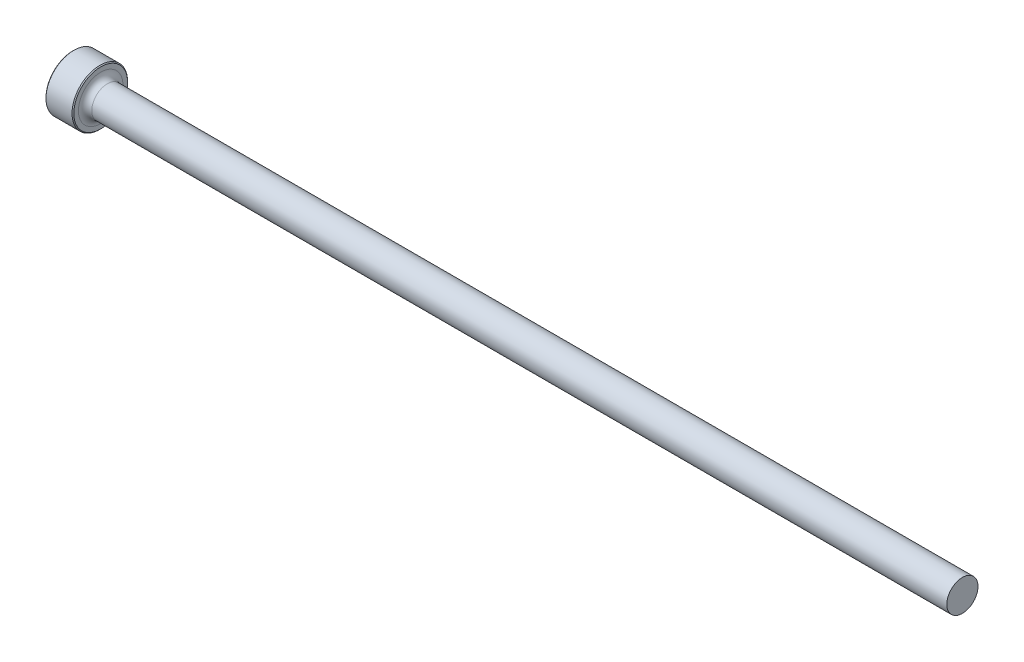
ISO-10303-21;
HEADER;
FILE_DESCRIPTION(('STEP AP214'),'2;1');
FILE_NAME('part.step','',(''),(''),'','','');
FILE_SCHEMA(('AUTOMOTIVE_DESIGN { 1 0 10303 214 1 1 1 1 }'));
ENDSEC;
DATA;
#1=APPLICATION_CONTEXT('core data for automotive mechanical design processes');
#2=APPLICATION_PROTOCOL_DEFINITION('international standard','automotive_design',2000,#1);
#3=PRODUCT_CONTEXT('',#1,'mechanical');
#4=PRODUCT('Part','Part','',(#3));
#5=PRODUCT_RELATED_PRODUCT_CATEGORY('part','',(#4));
#6=PRODUCT_DEFINITION_FORMATION('','',#4);
#7=PRODUCT_DEFINITION_CONTEXT('part definition',#1,'design');
#8=PRODUCT_DEFINITION('design','',#6,#7);
#9=PRODUCT_DEFINITION_SHAPE('','',#8);
#10=(LENGTH_UNIT() NAMED_UNIT(*) SI_UNIT(.MILLI.,.METRE.));
#11=(NAMED_UNIT(*) PLANE_ANGLE_UNIT() SI_UNIT($,.RADIAN.));
#12=(NAMED_UNIT(*) SI_UNIT($,.STERADIAN.) SOLID_ANGLE_UNIT());
#13=UNCERTAINTY_MEASURE_WITH_UNIT(LENGTH_MEASURE(1.E-05),#10,'distance_accuracy_value','');
#14=(GEOMETRIC_REPRESENTATION_CONTEXT(3) GLOBAL_UNCERTAINTY_ASSIGNED_CONTEXT((#13)) GLOBAL_UNIT_ASSIGNED_CONTEXT((#10,
#11,#12)) REPRESENTATION_CONTEXT('',''));
#15=CARTESIAN_POINT('',(0.,0.,0.));
#16=DIRECTION('',(0.,0.,1.));
#17=DIRECTION('',(1.,0.,0.));
#18=AXIS2_PLACEMENT_3D('',#15,#16,#17);
#19=CARTESIAN_POINT('',(101.6,1.78212749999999,0.));
#20=DIRECTION('',(1.,0.,0.));
#21=DIRECTION('',(0.,1.,0.));
#22=AXIS2_PLACEMENT_3D('',#19,#20,#21);
#23=PLANE('',#22);
#24=CARTESIAN_POINT('',(101.6,0.,0.));
#25=DIRECTION('',(1.,0.,0.));
#26=DIRECTION('',(0.,1.,0.));
#27=AXIS2_PLACEMENT_3D('',#24,#25,#26);
#28=CIRCLE('',#27,1.7821275);
#29=CARTESIAN_POINT('',(101.6,1.78212749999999,0.));
#30=VERTEX_POINT('',#29);
#31=EDGE_CURVE('E50',#30,#30,#28,.T.);
#32=ORIENTED_EDGE('',*,*,#31,.T.);
#33=EDGE_LOOP('',(#32));
#34=FACE_BOUND('',#33,.T.);
#35=ADVANCED_FACE('F30',(#34),#23,.T.);
#36=CARTESIAN_POINT('',(101.6,0.,0.));
#37=DIRECTION('',(1.,0.,0.));
#38=DIRECTION('',(0.,1.,0.));
#39=AXIS2_PLACEMENT_3D('',#36,#37,#38);
#40=CYLINDRICAL_SURFACE('',#39,1.7821275);
#41=CARTESIAN_POINT('',(3.937,0.,0.));
#42=DIRECTION('',(1.,0.,0.));
#43=DIRECTION('',(0.,1.,0.));
#44=AXIS2_PLACEMENT_3D('',#41,#42,#43);
#45=CIRCLE('',#44,1.78212749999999);
#46=CARTESIAN_POINT('',(3.937,1.78212749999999,0.));
#47=VERTEX_POINT('',#46);
#48=EDGE_CURVE('E53',#47,#47,#45,.T.);
#49=ORIENTED_EDGE('',*,*,#48,.T.);
#50=EDGE_LOOP('',(#49));
#51=FACE_BOUND('',#50,.T.);
#52=ORIENTED_EDGE('',*,*,#31,.F.);
#53=EDGE_LOOP('',(#52));
#54=FACE_BOUND('',#53,.T.);
#55=ADVANCED_FACE('F74',(#51,#54),#40,.T.);
#56=CARTESIAN_POINT('',(3.937,0.,0.));
#57=DIRECTION('',(1.,0.,0.));
#58=DIRECTION('',(0.,1.,0.));
#59=AXIS2_PLACEMENT_3D('',#56,#57,#58);
#60=TOROIDAL_SURFACE('',#59,2.54412749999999,0.762);
#61=CARTESIAN_POINT('',(3.175,0.,0.));
#62=DIRECTION('',(1.,0.,0.));
#63=DIRECTION('',(0.,1.,0.));
#64=AXIS2_PLACEMENT_3D('',#61,#62,#63);
#65=CIRCLE('',#64,2.54412749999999);
#66=CARTESIAN_POINT('',(3.175,2.54412749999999,0.));
#67=VERTEX_POINT('',#66);
#68=EDGE_CURVE('E56',#67,#67,#65,.T.);
#69=ORIENTED_EDGE('',*,*,#68,.T.);
#70=EDGE_LOOP('',(#69));
#71=FACE_BOUND('',#70,.T.);
#72=ORIENTED_EDGE('',*,*,#48,.F.);
#73=EDGE_LOOP('',(#72));
#74=FACE_BOUND('',#73,.T.);
#75=ADVANCED_FACE('F60',(#71,#74),#60,.F.);
#76=CARTESIAN_POINT('',(3.175,3.175,0.));
#77=DIRECTION('',(1.,0.,0.));
#78=DIRECTION('',(0.,1.,0.));
#79=AXIS2_PLACEMENT_3D('',#76,#77,#78);
#80=PLANE('',#79);
#81=CARTESIAN_POINT('',(3.175,0.,0.));
#82=DIRECTION('',(1.,0.,0.));
#83=DIRECTION('',(0.,1.,0.));
#84=AXIS2_PLACEMENT_3D('',#81,#82,#83);
#85=CIRCLE('',#84,3.07339999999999);
#86=CARTESIAN_POINT('',(3.175,3.07339999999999,0.));
#87=VERTEX_POINT('',#86);
#88=EDGE_CURVE('E10',#87,#87,#85,.T.);
#89=ORIENTED_EDGE('',*,*,#88,.T.);
#90=EDGE_LOOP('',(#89));
#91=FACE_BOUND('',#90,.T.);
#92=ORIENTED_EDGE('',*,*,#68,.F.);
#93=EDGE_LOOP('',(#92));
#94=FACE_BOUND('',#93,.T.);
#95=ADVANCED_FACE('F63',(#91,#94),#80,.T.);
#96=CARTESIAN_POINT('',(101.6,0.,0.));
#97=DIRECTION('',(1.,0.,0.));
#98=DIRECTION('',(0.,1.,0.));
#99=AXIS2_PLACEMENT_3D('',#96,#97,#98);
#100=CYLINDRICAL_SURFACE('',#99,3.175);
#101=CARTESIAN_POINT('',(0.101599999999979,0.,0.));
#102=DIRECTION('',(-1.,0.,0.));
#103=DIRECTION('',(0.,-1.,0.));
#104=AXIS2_PLACEMENT_3D('',#101,#102,#103);
#105=CIRCLE('',#104,3.175);
#106=CARTESIAN_POINT('',(0.101599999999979,-3.175,0.));
#107=VERTEX_POINT('',#106);
#108=EDGE_CURVE('E41',#107,#107,#105,.F.);
#109=ORIENTED_EDGE('',*,*,#108,.T.);
#110=EDGE_LOOP('',(#109));
#111=FACE_BOUND('',#110,.T.);
#112=CARTESIAN_POINT('',(3.07339999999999,0.,0.));
#113=DIRECTION('',(1.,0.,0.));
#114=DIRECTION('',(0.,1.,0.));
#115=AXIS2_PLACEMENT_3D('',#112,#113,#114);
#116=CIRCLE('',#115,3.175);
#117=CARTESIAN_POINT('',(3.07339999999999,3.175,0.));
#118=VERTEX_POINT('',#117);
#119=EDGE_CURVE('E45',#118,#118,#116,.F.);
#120=ORIENTED_EDGE('',*,*,#119,.T.);
#121=EDGE_LOOP('',(#120));
#122=FACE_BOUND('',#121,.T.);
#123=ADVANCED_FACE('F65',(#111,#122),#100,.T.);
#124=CARTESIAN_POINT('',(0.,0.,0.));
#125=DIRECTION('',(-1.,0.,0.));
#126=DIRECTION('',(0.,-1.,0.));
#127=AXIS2_PLACEMENT_3D('',#124,#125,#126);
#128=PLANE('',#127);
#129=CARTESIAN_POINT('',(0.,0.,0.));
#130=DIRECTION('',(-1.,0.,0.));
#131=DIRECTION('',(0.,-1.,0.));
#132=AXIS2_PLACEMENT_3D('',#129,#130,#131);
#133=CIRCLE('',#132,3.0734);
#134=CARTESIAN_POINT('',(0.,-3.0734,0.));
#135=VERTEX_POINT('',#134);
#136=EDGE_CURVE('E37',#135,#135,#133,.T.);
#137=ORIENTED_EDGE('',*,*,#136,.T.);
#138=EDGE_LOOP('',(#137));
#139=FACE_BOUND('',#138,.T.);
#140=ADVANCED_FACE('F71',(#139),#128,.T.);
#141=CARTESIAN_POINT('',(0.101599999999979,0.,0.));
#142=DIRECTION('',(1.,0.,0.));
#143=DIRECTION('',(0.,1.,0.));
#144=AXIS2_PLACEMENT_3D('',#141,#142,#143);
#145=CONICAL_SURFACE('',#144,3.175,0.785398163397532);
#146=ORIENTED_EDGE('',*,*,#136,.F.);
#147=EDGE_LOOP('',(#146));
#148=FACE_BOUND('',#147,.T.);
#149=ORIENTED_EDGE('',*,*,#108,.F.);
#150=EDGE_LOOP('',(#149));
#151=FACE_BOUND('',#150,.T.);
#152=ADVANCED_FACE('F84',(#148,#151),#145,.T.);
#153=CARTESIAN_POINT('',(3.175,0.,0.));
#154=DIRECTION('',(-1.,0.,0.));
#155=DIRECTION('',(0.,-1.,0.));
#156=AXIS2_PLACEMENT_3D('',#153,#154,#155);
#157=CONICAL_SURFACE('',#156,3.07339999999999,0.785398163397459);
#158=ORIENTED_EDGE('',*,*,#119,.F.);
#159=EDGE_LOOP('',(#158));
#160=FACE_BOUND('',#159,.T.);
#161=ORIENTED_EDGE('',*,*,#88,.F.);
#162=EDGE_LOOP('',(#161));
#163=FACE_BOUND('',#162,.T.);
#164=ADVANCED_FACE('F32',(#160,#163),#157,.T.);
#165=CLOSED_SHELL('',(#35,#55,#75,#95,#123,#140,#152,#164));
#166=MANIFOLD_SOLID_BREP('B2',#165);
#167=ADVANCED_BREP_SHAPE_REPRESENTATION('',(#18,#166),#14);
#168=SHAPE_DEFINITION_REPRESENTATION(#9,#167);
ENDSEC;
END-ISO-10303-21;
